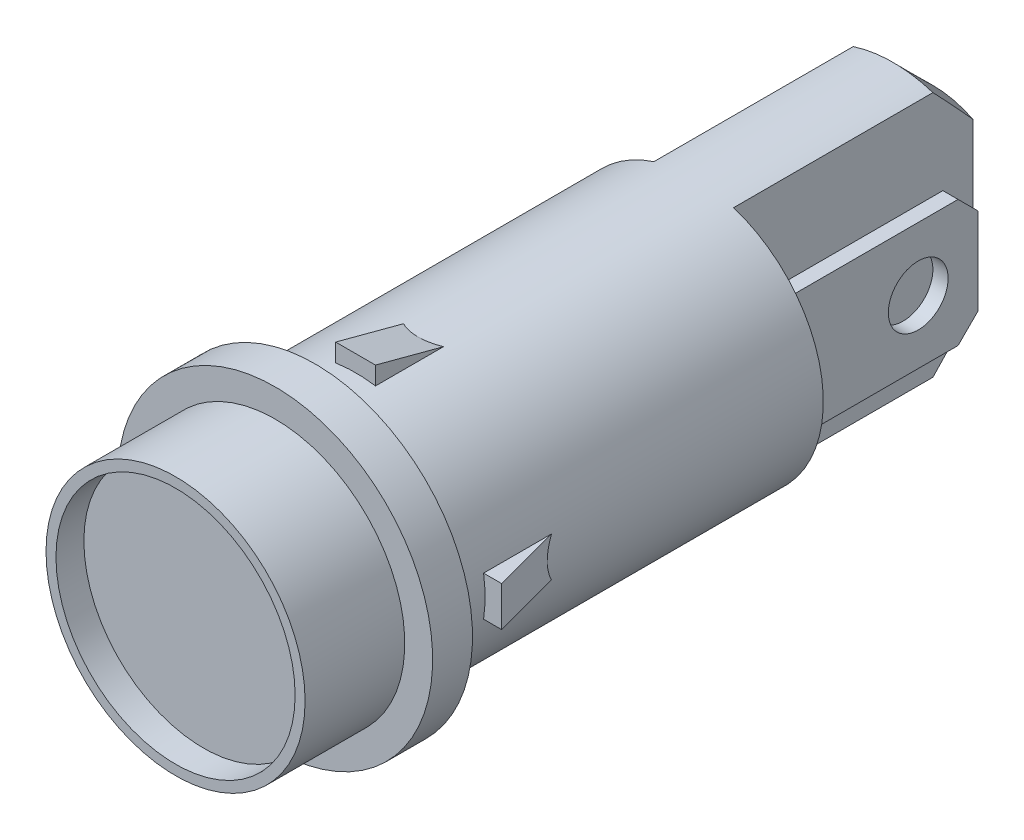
from build123d import *

# Parameters (mm, degrees)
SKETCH1_R                = 6.5
EXTRUDE1_DEPTH           = 36.6
SKETCH2_R                = 7.9
EXTRUDE2_DEPTH           = 2
CUT_EXTRUDE1_DEPTH       = 39.267218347
CUT_EXTRUDE1_DEPTH_BACK  = 39.267218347
SKETCH3_W                = 4.5
SKETCH3_H                = 12
SKETCH4_W                = 0.762
SKETCH4_H                = 6.35
EXTRUDE3_DEPTH           = 10
CHAMFER1_SIZE            = 1
CUT_EXTRUDE2_REACH       = 41.369
SKETCH5_R                = 1.5
CHAMFER1_OF_MIRROR1_SIZE = 1
CHAMFER2_SIZE            = 2
EXTRUDE4_DEPTH           = 1
CIRPATTERN1_COUNT        = 4
SKETCH7_R                = 6.5
SKETCH7_R_2              = 6
EXTRUDE_THIN1_DEPTH      = 5


with BuildPart() as part:
    # Sketch1 → Extrude1 (new body)
    with BuildSketch(Plane.XY):
        Circle(SKETCH1_R)
    extrude(amount=EXTRUDE1_DEPTH)

    # Sketch2 → Extrude2 (add)
    with BuildSketch(Plane(origin=(0, 0, 31), x_dir=(-1, 0, 0), z_dir=(0, 0, -1))):
        Circle(SKETCH2_R)
    extrude(amount=-EXTRUDE2_DEPTH)

    # Sketch3 → Cut-Extrude1 (cut, two sides: drawn at the far end of the back side and taken through both)
    with BuildSketch(Plane(origin=(0, 0, 0), x_dir=(1, 0, 0), z_dir=(0, 1, 0)).offset(-CUT_EXTRUDE1_DEPTH_BACK)):
        with Locations((4.25, -6)):
            Rectangle(SKETCH3_W, SKETCH3_H)
        with Locations((-4.25, -6)):
            Rectangle(SKETCH3_W, SKETCH3_H)
    extrude(amount=CUT_EXTRUDE1_DEPTH + CUT_EXTRUDE1_DEPTH_BACK, mode=Mode.SUBTRACT)

    # Sketch4 → Extrude3 (add)
    with BuildSketch(Plane(origin=(0, 0, 12), x_dir=(-1, 0, 0), z_dir=(0, 0, -1))):
        with Locations((-3.881, 0)):
            Rectangle(SKETCH4_W, SKETCH4_H)
    extrude3 = extrude(amount=EXTRUDE3_DEPTH)

    # Chamfer1
    chamfer1_edges = [part.edges().sort_by_distance(p)[0] for p in [
        (3.881, -3.175, 2),
        (3.881, 3.175, 2),
    ]]
    chamfer(chamfer1_edges, length=CHAMFER1_SIZE)

    # Sketch5 → Cut-Extrude2 (cut, up to next)
    with BuildSketch(Plane(origin=(4.262, 0, 0), x_dir=(0, 0, -1), z_dir=(1, 0, 0)), mode=Mode.PRIVATE) as cut_extrude2_sk1:
        with Locations((-5, 0)):
            Circle(SKETCH5_R)
    cut_extrude2_tool1 = extrude(cut_extrude2_sk1.sketch, amount=-CUT_EXTRUDE2_REACH, mode=Mode.PRIVATE) & part.part
    cut_extrude2 = cut_extrude2_tool1.solids().sort_by_distance((4.262, 0, 5))[0]
    add(cut_extrude2, mode=Mode.SUBTRACT)

    # Mirror1: Extrude3, Cut-Extrude2 across plane
    add(extrude3.mirror(Plane(origin=(0, 0, 0), x_dir=(0, 0, 1), z_dir=(1, 0, 0))))
    add(cut_extrude2.mirror(Plane(origin=(0, 0, 0), x_dir=(0, 0, 1), z_dir=(1, 0, 0))), mode=Mode.SUBTRACT)

    # Chamfer1 of Mirror1
    chamfer1_of_mirror1_edges = [part.edges().sort_by_distance(p)[0] for p in [
        (-3.881, -3.175, 2),
        (-3.881, 3.175, 2),
    ]]
    chamfer(chamfer1_of_mirror1_edges, length=CHAMFER1_OF_MIRROR1_SIZE)

    # Chamfer2
    chamfer2_edges = [part.edges().sort_by_distance(p)[0] for p in [
        (0, 6.5, 0),
        (0, -6.5, 0),
    ]]
    chamfer(chamfer2_edges, length=CHAMFER2_SIZE)

    # Sketch6 → Extrude4 (add, symmetric)
    with BuildSketch(Plane(origin=(0, 0, 0), x_dir=(1, 0, 0), z_dir=(0, 1, 0))):
        Polygon((4.701960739, -19.092839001), (7.329685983, -28.968), (4.701960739, -28.968), align=None)
    extrude4 = extrude(amount=EXTRUDE4_DEPTH, both=True)

    # CirPattern1: Extrude4 ×4 about axis
    cirpattern1_axis = Axis((0, 0, 0), (0, 0, 1))
    for i in range(1, CIRPATTERN1_COUNT):
        add(extrude4.rotate(cirpattern1_axis, i * 360 / CIRPATTERN1_COUNT))

    # Sketch7 → Extrude-Thin1 (add)
    with BuildSketch(Plane.XY.offset(33)):
        Circle(SKETCH7_R)
        Circle(SKETCH7_R_2, mode=Mode.SUBTRACT)
    extrude(amount=EXTRUDE_THIN1_DEPTH)


solid = part.part
